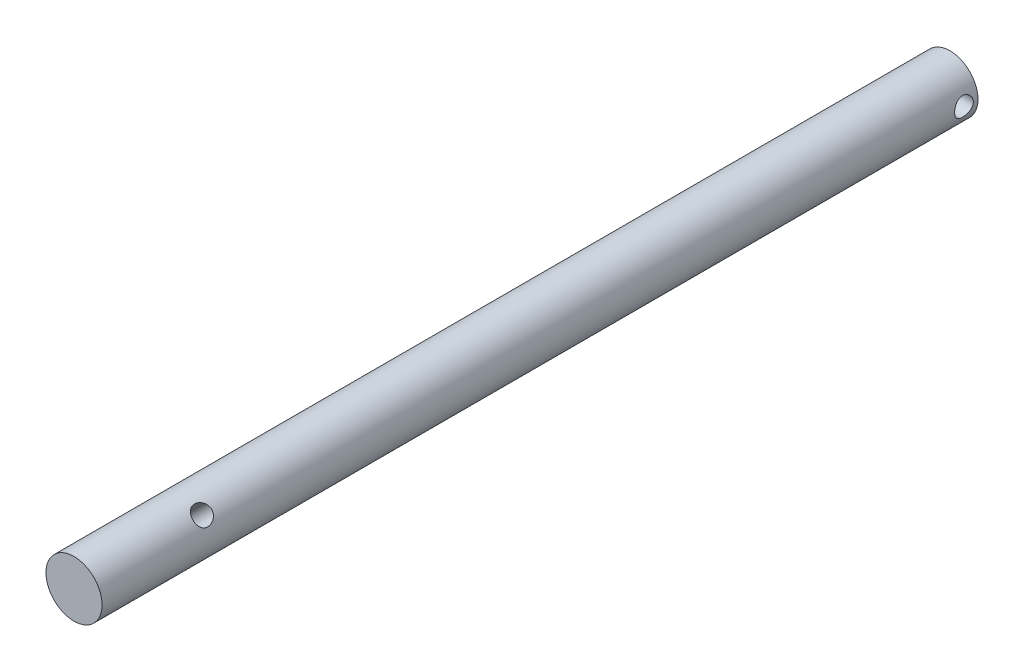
from build123d import *

# Parameters (mm, degrees)
ESQUISSE1_W                  = 468.41
ESQUISSE1_H                  = 15
ENL_V_MAT_EXTRU_1_DEPTH      = 469.890102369
ENL_V_MAT_EXTRU_1_DEPTH_BACK = 469.890102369
ESQUISSE2_R                  = 5
ENL_V_MAT_EXTRU_2_DEPTH      = 469.890102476
ENL_V_MAT_EXTRU_2_DEPTH_BACK = 469.890102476
ESQUISSE4_R                  = 5


with BuildPart() as part:
    # Esquisse1 → Base-R_volution (revolve)
    with BuildSketch(Plane(origin=(0, 0, 0), x_dir=(0, 0, -1), z_dir=(1, 0, 0)), mode=Mode.PRIVATE) as base_r_volution_sk:
        with Locations((-234.205, 7.5)):
            Rectangle(ESQUISSE1_W, ESQUISSE1_H)
    revolve(base_r_volution_sk.sketch.rotate(Axis((0, 0, 480), (0, 0, -1)), 90), axis=Axis((0, 0, 480), (0, 0, -1)))

    # Esquisse2 → Enl_v. mat.-Extru.1 (cut, two sides: drawn at the far end of the back side and taken through both)
    with BuildSketch(Plane(origin=(0, 0, 0), x_dir=(0, 0, -1), z_dir=(1, 0, 0)).offset(-ENL_V_MAT_EXTRU_1_DEPTH_BACK)):
        with Locations((-7.5, 0)):
            Circle(ESQUISSE2_R)
    extrude(amount=ENL_V_MAT_EXTRU_1_DEPTH + ENL_V_MAT_EXTRU_1_DEPTH_BACK, mode=Mode.SUBTRACT)

    # Esquisse4 → Enl_v. mat.-Extru.2 (cut, two sides: drawn at the far end of the back side and taken through both)
    with BuildSketch(Plane(origin=(0, 0, 0), x_dir=(0.7071067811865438, -0.7071067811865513, 0), z_dir=(-0.7071067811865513, -0.7071067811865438, 0)).offset(-ENL_V_MAT_EXTRU_2_DEPTH_BACK)):
        with Locations((0, 410.41)):
            Circle(ESQUISSE4_R)
    extrude(amount=ENL_V_MAT_EXTRU_2_DEPTH + ENL_V_MAT_EXTRU_2_DEPTH_BACK, mode=Mode.SUBTRACT)


solid = part.part
